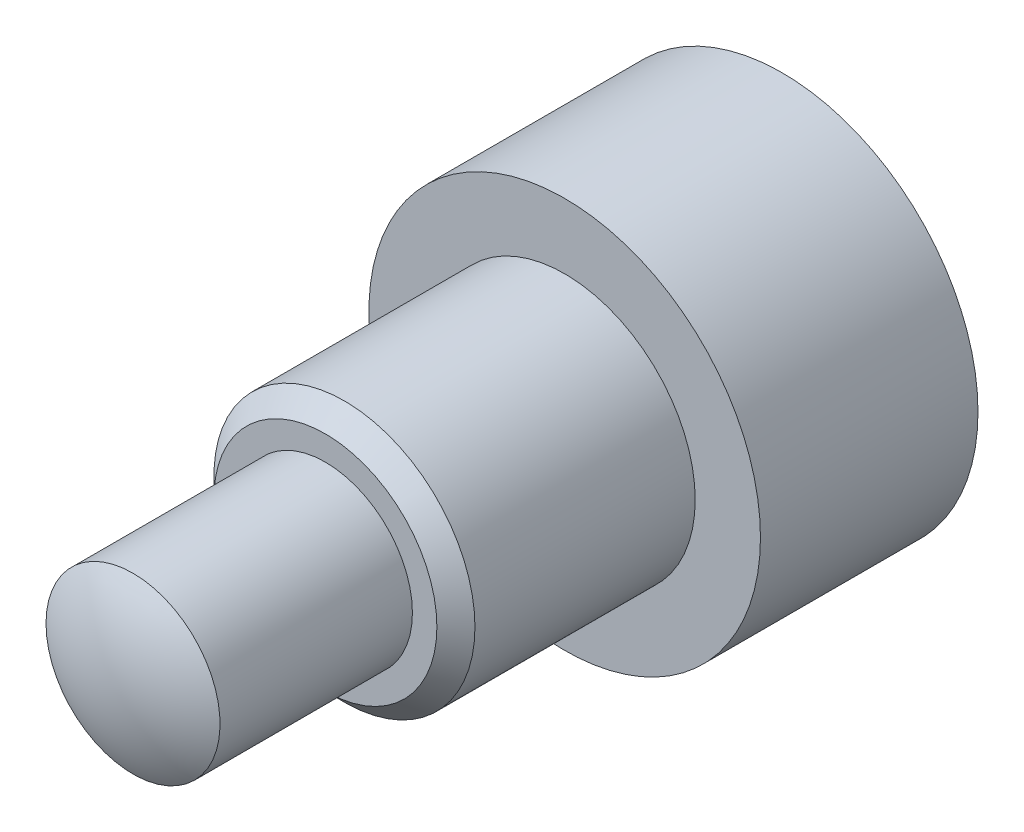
from build123d import *

# Parameters (mm, degrees)
ESQUISSE1_R      = 9
EXTRUSION1_DEPTH = 10
ESQUISSE2_R      = 6
EXTRUSION2_DEPTH = 11
ESQUISSE3_R      = 4
EXTRUSION3_DEPTH = 10
CHANFREIN1_SIZE  = 0.875


with BuildPart() as part:
    # Esquisse1 → Extrusion1 (new body)
    with BuildSketch(Plane.XY):
        Circle(ESQUISSE1_R)
    extrude(amount=EXTRUSION1_DEPTH)

    # Esquisse2 → Extrusion2 (add)
    with BuildSketch(Plane.XY.offset(10)):
        Circle(ESQUISSE2_R)
    extrude(amount=EXTRUSION2_DEPTH)

    # Esquisse3 → Extrusion3 (add)
    with BuildSketch(Plane.XY.offset(21)):
        Circle(ESQUISSE3_R)
    extrude(amount=EXTRUSION3_DEPTH)

    # Esquisse4 → Enl_vement de mati_re-R_volution6 (revolve, cut)
    with BuildSketch(Plane(origin=(0, 0, 0), x_dir=(0, 0, -1), z_dir=(1, 0, 0)), mode=Mode.PRIVATE) as enl_vement_de_mati_re_r_volution6_sk:
        with BuildLine():
            Line((-29.824056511, 4.031911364), (-36.851534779, 7.02000536))
            Line((-36.851534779, 7.02000536), (-38.740147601, 0))
            Line((-38.740147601, 0), (-31, 0))
            ThreePointArc((-31, 0), (-30.700014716, 2.099949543), (-29.824056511, 4.031911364))
        make_face()
    revolve(enl_vement_de_mati_re_r_volution6_sk.sketch.rotate(Axis((0, 0, 26.588443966), (0, 0, 1)), 90), axis=Axis((0, 0, 26.588443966), (0, 0, 1)), mode=Mode.SUBTRACT)

    # Chanfrein1
    chanfrein1_edges = [part.edges().sort_by_distance(p)[0] for p in [
        (-6, 0, 21),
    ]]
    chamfer(chanfrein1_edges, length=CHANFREIN1_SIZE)


solid = part.part
